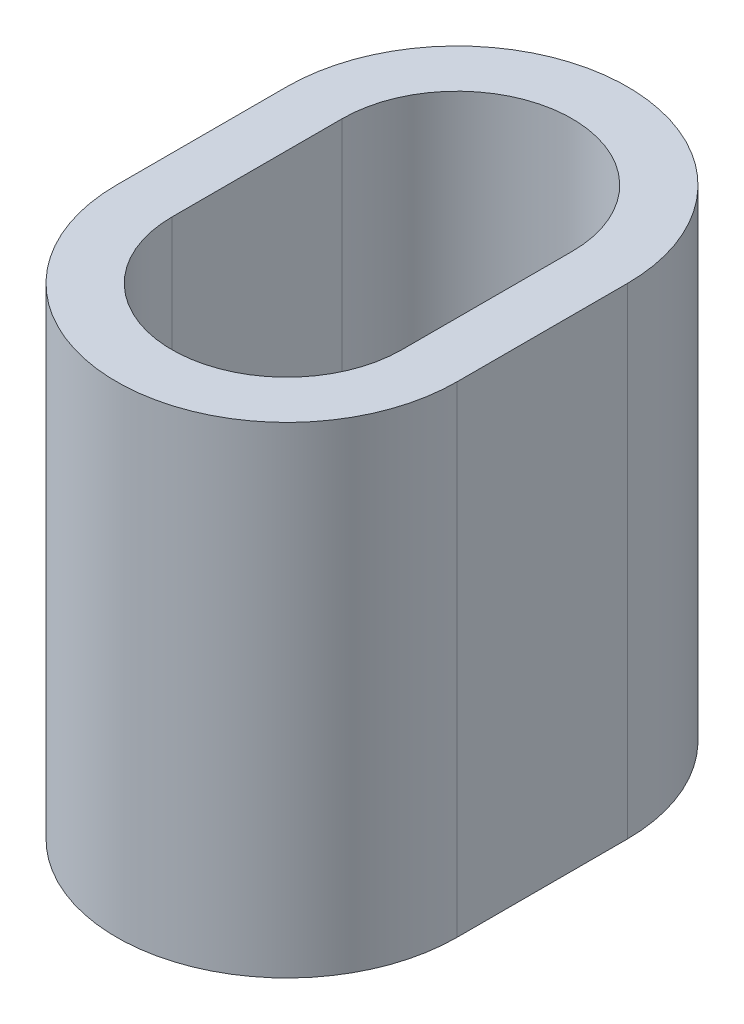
from build123d import *

# Parameters (mm, degrees)
BOSS_EXTRU_1_DEPTH = 11.3


with BuildPart() as part:
    # Esquisse1 → Boss.-Extru.1 (new body)
    with BuildSketch(Plane.XZ):
        with BuildLine():
            Line((4, -2), (4, 2))
            ThreePointArc((4, 2), (0, 6), (-4, 2))
            Line((-4, 2), (-4, -2))
            ThreePointArc((-4, -2), (0, -6), (4, -2))
        make_face()
        with BuildLine():
            Line((-2.7, -2), (-2.7, 2))
            ThreePointArc((-2.7, 2), (0, 4.7), (2.7, 2))
            Line((2.7, 2), (2.7, -2))
            ThreePointArc((2.7, -2), (0, -4.7), (-2.7, -2))
        make_face(mode=Mode.SUBTRACT)
    extrude(amount=-BOSS_EXTRU_1_DEPTH)


solid = part.part
